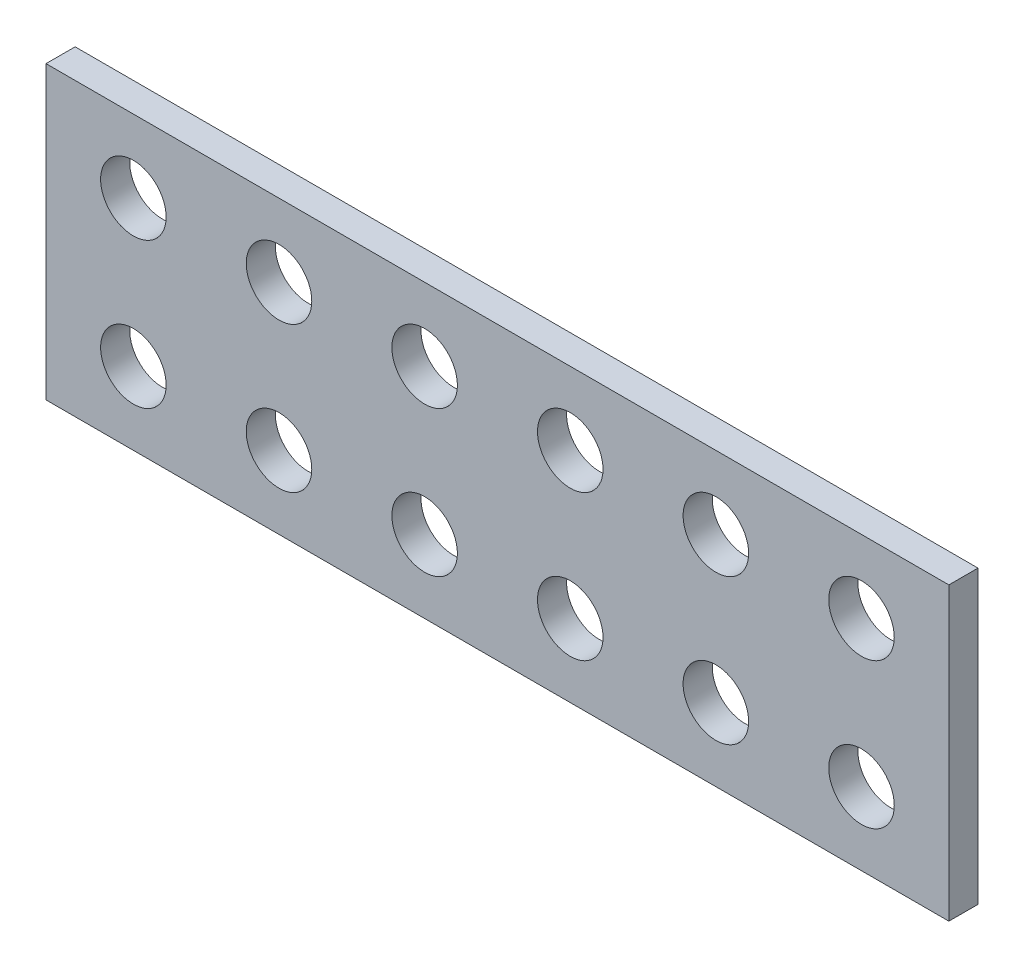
from build123d import *

# Parameters (mm, degrees)
SKETCH_1_W           = 140
SKETCH_1_H           = 60
EXTRUDE_1_DEPTH      = 4
SKETCH_2_R           = 4.5
CUT_EXTRUDE_1_DEPTH  = 153.367975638
SKETCH_3_OUTSIDE_W   = 172.474
SKETCH_3_OUTSIDE_H   = 92.474
SKETCH_3_OUTSIDE_W_2 = 124
SKETCH_3_OUTSIDE_H_2 = 40
CUT_EXTRUDE_2_DEPTH  = 153.367975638


with BuildPart() as part:
    # Sketch 1 → Extrude 1 (new body)
    with BuildSketch(Plane.XY):
        with Locations((70, 30)):
            Rectangle(SKETCH_1_W, SKETCH_1_H)
    extrude(amount=EXTRUDE_1_DEPTH)

    # Sketch 2 → Cut-Extrude 1 (cut, through all)
    with BuildSketch(Plane.XY.offset(4)):
        with Locations((20, 40)):
            Circle(SKETCH_2_R)
        with Locations((40, 40)):
            Circle(SKETCH_2_R)
        with Locations((60, 40)):
            Circle(SKETCH_2_R)
        with Locations((80, 40)):
            Circle(SKETCH_2_R)
        with Locations((100, 40)):
            Circle(SKETCH_2_R)
        with Locations((120, 40)):
            Circle(SKETCH_2_R)
        with Locations((40, 20)):
            Circle(SKETCH_2_R)
        with Locations((60, 20)):
            Circle(SKETCH_2_R)
        with Locations((80, 20)):
            Circle(SKETCH_2_R)
        with Locations((100, 20)):
            Circle(SKETCH_2_R)
        with Locations((120, 20)):
            Circle(SKETCH_2_R)
        with Locations((20, 20)):
            Circle(SKETCH_2_R)
    extrude(amount=-CUT_EXTRUDE_1_DEPTH, mode=Mode.SUBTRACT)

    # Sketch 3 outside → Cut-Extrude 2 (cut, through all)
    with BuildSketch(Plane.XY.offset(4)):
        with Locations((70, 30)):
            Rectangle(SKETCH_3_OUTSIDE_W, SKETCH_3_OUTSIDE_H)
        with Locations((70, 30)):
            Rectangle(SKETCH_3_OUTSIDE_W_2, SKETCH_3_OUTSIDE_H_2, mode=Mode.SUBTRACT)
    extrude(amount=-CUT_EXTRUDE_2_DEPTH, mode=Mode.SUBTRACT)


solid = part.part
